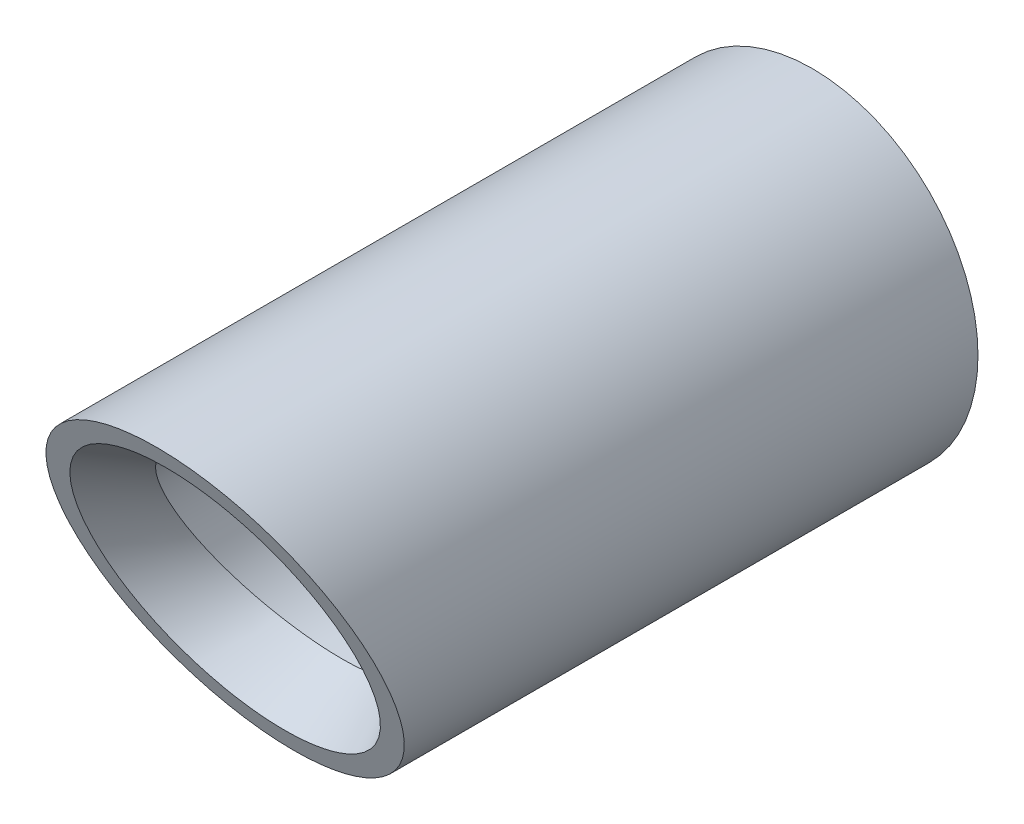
ISO-10303-21;
HEADER;
FILE_DESCRIPTION(('STEP AP214'),'2;1');
FILE_NAME('part.step','',(''),(''),'','','');
FILE_SCHEMA(('AUTOMOTIVE_DESIGN { 1 0 10303 214 1 1 1 1 }'));
ENDSEC;
DATA;
#1=APPLICATION_CONTEXT('core data for automotive mechanical design processes');
#2=APPLICATION_PROTOCOL_DEFINITION('international standard','automotive_design',2000,#1);
#3=PRODUCT_CONTEXT('',#1,'mechanical');
#4=PRODUCT('Part','Part','',(#3));
#5=PRODUCT_RELATED_PRODUCT_CATEGORY('part','',(#4));
#6=PRODUCT_DEFINITION_FORMATION('','',#4);
#7=PRODUCT_DEFINITION_CONTEXT('part definition',#1,'design');
#8=PRODUCT_DEFINITION('design','',#6,#7);
#9=PRODUCT_DEFINITION_SHAPE('','',#8);
#10=(LENGTH_UNIT() NAMED_UNIT(*) SI_UNIT(.MILLI.,.METRE.));
#11=(NAMED_UNIT(*) PLANE_ANGLE_UNIT() SI_UNIT($,.RADIAN.));
#12=(NAMED_UNIT(*) SI_UNIT($,.STERADIAN.) SOLID_ANGLE_UNIT());
#13=UNCERTAINTY_MEASURE_WITH_UNIT(LENGTH_MEASURE(1.E-05),#10,'distance_accuracy_value','');
#14=(GEOMETRIC_REPRESENTATION_CONTEXT(3) GLOBAL_UNCERTAINTY_ASSIGNED_CONTEXT((#13)) GLOBAL_UNIT_ASSIGNED_CONTEXT((#10,
#11,#12)) REPRESENTATION_CONTEXT('',''));
#15=CARTESIAN_POINT('',(0.,0.,0.));
#16=DIRECTION('',(0.,0.,1.));
#17=DIRECTION('',(1.,0.,0.));
#18=AXIS2_PLACEMENT_3D('',#15,#16,#17);
#19=CARTESIAN_POINT('',(0.,0.,30.));
#20=DIRECTION('',(0.,0.,-1.));
#21=DIRECTION('',(-1.,0.,0.));
#22=AXIS2_PLACEMENT_3D('',#19,#20,#21);
#23=CYLINDRICAL_SURFACE('',#22,5.);
#24=CARTESIAN_POINT('',(0.,0.,1.73205080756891));
#25=DIRECTION('',(0.,0.,1.));
#26=DIRECTION('',(1.,0.,0.));
#27=AXIS2_PLACEMENT_3D('',#24,#25,#26);
#28=CIRCLE('',#27,5.);
#29=CARTESIAN_POINT('',(5.,0.,1.73205080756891));
#30=VERTEX_POINT('',#29);
#31=EDGE_CURVE('E40',#30,#30,#28,.F.);
#32=ORIENTED_EDGE('',*,*,#31,.T.);
#33=EDGE_LOOP('',(#32));
#34=FACE_BOUND('',#33,.T.);
#35=CARTESIAN_POINT('',(-5.,0.,24.3936605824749));
#36=CARTESIAN_POINT('',(-5.0000003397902,-0.159161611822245,24.3081910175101));
#37=CARTESIAN_POINT('',(-4.99240063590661,-0.318190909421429,24.2224657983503));
#38=CARTESIAN_POINT('',(-4.96207160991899,-0.634952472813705,24.0511545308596));
#39=CARTESIAN_POINT('',(-4.93933648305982,-0.792684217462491,23.9655685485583));
#40=CARTESIAN_POINT('',(-4.87877492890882,-1.10591748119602,23.7949477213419));
#41=CARTESIAN_POINT('',(-4.84092095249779,-1.26141438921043,23.7099141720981));
#42=CARTESIAN_POINT('',(-4.75022491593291,-1.56876598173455,23.5412968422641));
#43=CARTESIAN_POINT('',(-4.69738436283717,-1.72062103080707,23.4577129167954));
#44=CARTESIAN_POINT('',(-4.57671977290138,-2.01983250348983,23.2924054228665));
#45=CARTESIAN_POINT('',(-4.50886158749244,-2.16717778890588,23.2106865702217));
#46=CARTESIAN_POINT('',(-4.35839340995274,-2.45578541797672,23.0501338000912));
#47=CARTESIAN_POINT('',(-4.27578428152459,-2.59704811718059,22.971299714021));
#48=CARTESIAN_POINT('',(-4.09610883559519,-2.87208395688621,22.8172871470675));
#49=CARTESIAN_POINT('',(-3.99904929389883,-3.0058605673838,22.7421069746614));
#50=CARTESIAN_POINT('',(-3.79077612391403,-3.2645955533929,22.5963034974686));
#51=CARTESIAN_POINT('',(-3.67956416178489,-3.38955496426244,22.5256796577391));
#52=CARTESIAN_POINT('',(-3.45291396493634,-3.61957727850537,22.395299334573));
#53=CARTESIAN_POINT('',(-3.33851990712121,-3.72543217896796,22.335125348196));
#54=CARTESIAN_POINT('',(-3.09872175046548,-3.92714384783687,22.2202202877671));
#55=CARTESIAN_POINT('',(-2.97331969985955,-4.02300246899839,22.1654882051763));
#56=CARTESIAN_POINT('',(-2.71235347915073,-4.20336492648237,22.0622872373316));
#57=CARTESIAN_POINT('',(-2.5767982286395,-4.28787855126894,22.0138129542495));
#58=CARTESIAN_POINT('',(-2.296414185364,-4.44434915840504,21.9239263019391));
#59=CARTESIAN_POINT('',(-2.151587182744,-4.51630855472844,21.8825125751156));
#60=CARTESIAN_POINT('',(-1.87465804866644,-4.63737144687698,21.8127340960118));
#61=CARTESIAN_POINT('',(-1.74358999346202,-4.68826206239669,21.7833554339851));
#62=CARTESIAN_POINT('',(-1.47650848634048,-4.7791011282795,21.7308781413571));
#63=CARTESIAN_POINT('',(-1.34049599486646,-4.81905169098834,21.7077782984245));
#64=CARTESIAN_POINT('',(-1.06475394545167,-4.88737776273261,21.6682284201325));
#65=CARTESIAN_POINT('',(-0.925027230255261,-4.91576186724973,21.6517734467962));
#66=CARTESIAN_POINT('',(-0.643029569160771,-4.96053287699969,21.6258296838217));
#67=CARTESIAN_POINT('',(-0.500758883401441,-4.9769210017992,21.6163401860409));
#68=CARTESIAN_POINT('',(-0.232272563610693,-4.99619087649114,21.6051590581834));
#69=CARTESIAN_POINT('',(-0.106187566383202,-5.00046190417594,21.6026657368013));
#70=CARTESIAN_POINT('',(0.145923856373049,-4.99945914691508,21.60324817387));
#71=CARTESIAN_POINT('',(0.271950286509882,-4.99418631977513,21.606323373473));
#72=CARTESIAN_POINT('',(0.522966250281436,-4.97416899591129,21.6179363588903));
#73=CARTESIAN_POINT('',(0.647955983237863,-4.95942636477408,21.6264730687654));
#74=CARTESIAN_POINT('',(0.895997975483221,-4.92066504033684,21.6489311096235));
#75=CARTESIAN_POINT('',(1.01905021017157,-4.89664622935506,21.662852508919));
#76=CARTESIAN_POINT('',(1.25862810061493,-4.84050920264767,21.6953606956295));
#77=CARTESIAN_POINT('',(1.37523832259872,-4.80866060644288,21.7137920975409));
#78=CARTESIAN_POINT('',(1.60514859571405,-4.7368772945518,21.7552795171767));
#79=CARTESIAN_POINT('',(1.71844726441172,-4.69693925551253,21.7783374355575));
#80=CARTESIAN_POINT('',(1.94101795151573,-4.60941955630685,21.8288406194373));
#81=CARTESIAN_POINT('',(2.05029052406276,-4.56183895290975,21.8562852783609));
#82=CARTESIAN_POINT('',(2.26428907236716,-4.45949148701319,21.9152146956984));
#83=CARTESIAN_POINT('',(2.36901464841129,-4.40472399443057,21.9466998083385));
#84=CARTESIAN_POINT('',(2.57994893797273,-4.28479932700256,22.0155614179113));
#85=CARTESIAN_POINT('',(2.68582681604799,-4.21920245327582,22.0531854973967));
#86=CARTESIAN_POINT('',(2.89140624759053,-4.08106690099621,22.1322822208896));
#87=CARTESIAN_POINT('',(2.99110844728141,-4.00852895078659,22.1737544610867));
#88=CARTESIAN_POINT('',(3.18399033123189,-3.8571023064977,22.2601475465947));
#89=CARTESIAN_POINT('',(3.27716944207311,-3.7782130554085,22.3050686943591));
#90=CARTESIAN_POINT('',(3.45673511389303,-3.61465712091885,22.3980510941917));
#91=CARTESIAN_POINT('',(3.54311755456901,-3.52998699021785,22.4461142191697));
#92=CARTESIAN_POINT('',(3.7186440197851,-3.34511444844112,22.5508002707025));
#93=CARTESIAN_POINT('',(3.80690182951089,-3.24426053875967,22.6077625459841));
#94=CARTESIAN_POINT('',(3.97432818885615,-3.03685874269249,22.7246398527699));
#95=CARTESIAN_POINT('',(4.05349275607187,-2.93030839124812,22.7845561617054));
#96=CARTESIAN_POINT('',(4.27711220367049,-2.60307767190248,22.9680545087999));
#97=CARTESIAN_POINT('',(4.40772229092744,-2.37478630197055,23.0954037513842));
#98=CARTESIAN_POINT('',(4.58198138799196,-2.00676308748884,23.2996048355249));
#99=CARTESIAN_POINT('',(4.63872770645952,-1.87177247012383,23.3742891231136));
#100=CARTESIAN_POINT('',(4.73993811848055,-1.59818825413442,23.5251163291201));
#101=CARTESIAN_POINT('',(4.78441391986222,-1.45959822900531,23.6012577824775));
#102=CARTESIAN_POINT('',(4.86104850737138,-1.1795407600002,23.754677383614));
#103=CARTESIAN_POINT('',(4.89319778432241,-1.03807118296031,23.831956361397));
#104=CARTESIAN_POINT('',(4.94507786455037,-0.753110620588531,23.9870519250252));
#105=CARTESIAN_POINT('',(4.96480504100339,-0.609619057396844,24.0648686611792));
#106=CARTESIAN_POINT('',(4.9928941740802,-0.309281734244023,24.2272669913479));
#107=CARTESIAN_POINT('',(5.00014706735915,-0.15233796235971,24.3118611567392));
#108=CARTESIAN_POINT('',(4.99984845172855,0.16180465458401,24.4805438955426));
#109=CARTESIAN_POINT('',(4.99229698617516,0.319003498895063,24.5646324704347));
#110=CARTESIAN_POINT('',(4.96232896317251,0.632533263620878,24.7318170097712));
#111=CARTESIAN_POINT('',(4.93991108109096,0.788864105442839,24.8149128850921));
#112=CARTESIAN_POINT('',(4.88015641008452,1.09959411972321,24.9794957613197));
#113=CARTESIAN_POINT('',(4.84281409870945,1.25399255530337,25.060982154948));
#114=CARTESIAN_POINT('',(4.75293216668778,1.56055087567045,25.2222821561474));
#115=CARTESIAN_POINT('',(4.70029673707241,1.71269008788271,25.3020817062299));
#116=CARTESIAN_POINT('',(4.57996974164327,2.01244804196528,25.4588257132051));
#117=CARTESIAN_POINT('',(4.51227941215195,2.16006715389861,25.5357704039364));
#118=CARTESIAN_POINT('',(4.39957508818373,2.3770548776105,25.6485218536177));
#119=CARTESIAN_POINT('',(4.36013336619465,2.44866267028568,25.6856710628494));
#120=CARTESIAN_POINT('',(4.27757017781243,2.59019409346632,25.7590176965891));
#121=CARTESIAN_POINT('',(4.23444966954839,2.66011815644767,25.7952153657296));
#122=CARTESIAN_POINT('',(4.09964078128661,2.86705867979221,25.90218353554));
#123=CARTESIAN_POINT('',(4.0024449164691,3.00135961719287,25.9713895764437));
#124=CARTESIAN_POINT('',(3.80151376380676,3.25150986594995,26.0999745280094));
#125=CARTESIAN_POINT('',(3.69878296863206,3.36798992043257,26.159701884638));
#126=CARTESIAN_POINT('',(3.48165257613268,3.59199178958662,26.2743555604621));
#127=CARTESIAN_POINT('',(3.36725988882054,3.69951884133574,26.3292846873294));
#128=CARTESIAN_POINT('',(3.12744698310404,3.90434745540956,26.433683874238));
#129=CARTESIAN_POINT('',(3.00203149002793,4.00165336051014,26.4831562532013));
#130=CARTESIAN_POINT('',(2.74101317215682,4.18476453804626,26.5761641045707));
#131=CARTESIAN_POINT('',(2.60541179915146,4.27057144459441,26.619700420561));
#132=CARTESIAN_POINT('',(2.34156135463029,4.42010253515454,26.695404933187));
#133=CARTESIAN_POINT('',(2.21432027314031,4.48523674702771,26.7283077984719));
#134=CARTESIAN_POINT('',(1.95364805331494,4.60475995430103,26.7886784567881));
#135=CARTESIAN_POINT('',(1.82021740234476,4.6591497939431,26.8161466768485));
#136=CARTESIAN_POINT('',(1.54827627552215,4.75643570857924,26.8652071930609));
#137=CARTESIAN_POINT('',(1.40976903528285,4.79933896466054,26.8868031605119));
#138=CARTESIAN_POINT('',(1.1287857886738,4.8730826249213,26.9239089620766));
#139=CARTESIAN_POINT('',(0.986310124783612,4.90392406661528,26.9394193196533));
#140=CARTESIAN_POINT('',(0.713388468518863,4.95057975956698,26.9628964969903));
#141=CARTESIAN_POINT('',(0.583200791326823,4.96760745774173,26.9714721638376));
#142=CARTESIAN_POINT('',(0.321657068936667,4.99137001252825,26.9834053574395));
#143=CARTESIAN_POINT('',(0.190301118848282,4.99810569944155,26.9867633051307));
#144=CARTESIAN_POINT('',(-0.0725264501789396,5.00120073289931,26.9883119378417));
#145=CARTESIAN_POINT('',(-0.203998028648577,4.99756286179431,26.9865040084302));
#146=CARTESIAN_POINT('',(-0.466072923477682,4.97996212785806,26.9776788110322));
#147=CARTESIAN_POINT('',(-0.596676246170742,4.96599934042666,26.9706615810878));
#148=CARTESIAN_POINT('',(-0.850526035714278,4.92872834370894,26.9519042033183));
#149=CARTESIAN_POINT('',(-0.973850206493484,4.90583986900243,26.9403761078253));
#150=CARTESIAN_POINT('',(-1.21794441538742,4.85100574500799,26.9127920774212));
#151=CARTESIAN_POINT('',(-1.33871457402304,4.81906052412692,26.8967363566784));
#152=CARTESIAN_POINT('',(-1.5769138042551,4.74645625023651,26.8601776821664));
#153=CARTESIAN_POINT('',(-1.69434283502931,4.70579709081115,26.8396746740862));
#154=CARTESIAN_POINT('',(-1.92515338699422,4.61617947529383,26.7944479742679));
#155=CARTESIAN_POINT('',(-2.03853464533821,4.56722048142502,26.7697240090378));
#156=CARTESIAN_POINT('',(-2.26376626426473,4.45997282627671,26.7155423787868));
#157=CARTESIAN_POINT('',(-2.3754816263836,4.40145863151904,26.6859701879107));
#158=CARTESIAN_POINT('',(-2.59331510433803,4.27673582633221,26.6228164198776));
#159=CARTESIAN_POINT('',(-2.69943397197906,4.21052825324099,26.5892353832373));
#160=CARTESIAN_POINT('',(-2.90557712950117,4.07100847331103,26.5183974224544));
#161=CARTESIAN_POINT('',(-3.0056019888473,3.99769693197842,26.4811408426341));
#162=CARTESIAN_POINT('',(-3.19919356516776,3.84452929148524,26.4032005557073));
#163=CARTESIAN_POINT('',(-3.29275614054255,3.76466906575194,26.3625146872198));
#164=CARTESIAN_POINT('',(-3.48021655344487,3.59243208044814,26.2745815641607));
#165=CARTESIAN_POINT('',(-3.57354010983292,3.49956514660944,26.2270697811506));
#166=CARTESIAN_POINT('',(-3.75184640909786,3.30768924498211,26.1287644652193));
#167=CARTESIAN_POINT('',(-3.83682552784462,3.20867763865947,26.077969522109));
#168=CARTESIAN_POINT('',(-3.99816325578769,3.00525435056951,25.9733791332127));
#169=CARTESIAN_POINT('',(-4.07451679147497,2.90083954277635,25.9195819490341));
#170=CARTESIAN_POINT('',(-4.21832325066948,2.68743425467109,25.8093712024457));
#171=CARTESIAN_POINT('',(-4.28577896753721,2.57844522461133,25.7529584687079));
#172=CARTESIAN_POINT('',(-4.41857948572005,2.34439311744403,25.6315864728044));
#173=CARTESIAN_POINT('',(-4.48288697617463,2.21887551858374,25.5663671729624));
#174=CARTESIAN_POINT('',(-4.60022929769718,1.96406588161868,25.4335570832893));
#175=CARTESIAN_POINT('',(-4.65327400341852,1.83477726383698,25.3659684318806));
#176=CARTESIAN_POINT('',(-4.74809043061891,1.57320553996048,25.2288916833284));
#177=CARTESIAN_POINT('',(-4.78986772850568,1.44092395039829,25.1594045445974));
#178=CARTESIAN_POINT('',(-4.86214696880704,1.17415009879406,25.0188511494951));
#179=CARTESIAN_POINT('',(-4.8926490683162,1.03965786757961,24.9477849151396));
#180=CARTESIAN_POINT('',(-4.94504029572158,0.754801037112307,24.7968127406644));
#181=CARTESIAN_POINT('',(-4.96566364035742,0.604273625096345,24.7167724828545));
#182=CARTESIAN_POINT('',(-4.99314343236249,0.302457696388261,24.5557852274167));
#183=CARTESIAN_POINT('',(-4.99999967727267,0.151169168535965,24.4748382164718));
#184=CARTESIAN_POINT('',(-5.,0.,24.3936605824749));
#185=B_SPLINE_CURVE_WITH_KNOTS('',3,(#35,#36,#37,#38,#39,#40,#41,#42,#43,#44,#45,#46,#47,#48,
#49,#50,#51,#52,#53,#54,#55,#56,#57,#58,#59,#60,#61,#62,#63,#64,#65,#66,#67,#68,#69,#70,#71,#72,
#73,#74,#75,#76,#77,#78,#79,#80,#81,#82,#83,#84,#85,#86,#87,#88,#89,#90,#91,#92,#93,#94,#95,#96,
#97,#98,#99,#100,#101,#102,#103,#104,#105,#106,#107,#108,#109,#110,#111,#112,#113,#114,#115,
#116,#117,#118,#119,#120,#121,#122,#123,#124,#125,#126,#127,#128,#129,#130,#131,#132,#133,#134,
#135,#136,#137,#138,#139,#140,#141,#142,#143,#144,#145,#146,#147,#148,#149,#150,#151,#152,#153,
#154,#155,#156,#157,#158,#159,#160,#161,#162,#163,#164,#165,#166,#167,#168,#169,#170,#171,#172,
#173,#174,#175,#176,#177,#178,#179,#180,#181,#182,#183,#184),.UNSPECIFIED.,.T.,.F.,(4,2,2,2,2,2,
2,2,2,2,2,2,2,2,2,2,2,2,2,2,2,2,2,2,2,2,2,2,2,2,2,2,2,2,2,2,2,2,2,2,2,2,2,2,2,2,2,2,2,2,2,2,2,2,
2,2,2,2,2,2,2,2,2,2,2,2,2,2,2,2,2,2,2,2,4),(0.,0.541824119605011,1.08385616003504,
1.62688041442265,2.16985008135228,2.71406732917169,3.25825272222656,3.80218374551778,
4.34605079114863,4.84654898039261,5.34695423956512,5.84692493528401,6.34679938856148,
6.77710730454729,7.20733207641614,7.63723654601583,8.06709730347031,8.44517246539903,
8.82320968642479,9.20117245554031,9.57914001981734,9.94556992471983,10.312150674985,
10.6786807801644,11.0452430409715,11.4351666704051,11.8250494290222,12.2149664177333,
12.6051179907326,13.0415126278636,13.4780976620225,14.3511294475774,14.8438680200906,
15.3361348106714,15.828780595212,16.3215701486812,16.8562632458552,17.3909547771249,
17.9256939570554,18.4606311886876,18.998994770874,19.5373141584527,19.8066191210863,
20.075854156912,20.6138937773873,21.1124193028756,21.610651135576,22.1086704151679,
22.6066188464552,23.0460636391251,23.4854738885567,23.9246087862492,24.3637059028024,
24.7579372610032,25.1521368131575,25.5462306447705,25.9403215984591,26.31776348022,
26.6951875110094,27.0726161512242,27.4500692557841,27.8382454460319,28.2263693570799,
28.6144569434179,29.0027909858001,29.4222527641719,29.8418959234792,30.2617846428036,
30.6815412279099,31.1471953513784,31.6124395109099,32.077452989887,32.542459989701,
33.0570683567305,33.5716842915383),.UNSPECIFIED.);
#186=CARTESIAN_POINT('',(-5.,0.,24.3936605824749));
#187=VERTEX_POINT('',#186);
#188=EDGE_CURVE('E144',#187,#187,#185,.T.);
#189=ORIENTED_EDGE('',*,*,#188,.T.);
#190=EDGE_LOOP('',(#189));
#191=FACE_BOUND('',#190,.T.);
#192=ADVANCED_FACE('F117',(#34,#191),#23,.F.);
#193=CARTESIAN_POINT('',(0.,0.,30.));
#194=DIRECTION('',(0.,0.,-1.));
#195=DIRECTION('',(-1.,0.,0.));
#196=AXIS2_PLACEMENT_3D('',#193,#194,#195);
#197=CYLINDRICAL_SURFACE('',#196,7.5);
#198=CARTESIAN_POINT('',(0.,0.,0.288675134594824));
#199=DIRECTION('',(0.,0.,-1.));
#200=DIRECTION('',(-1.,0.,0.));
#201=AXIS2_PLACEMENT_3D('',#198,#199,#200);
#202=CIRCLE('',#201,7.5);
#203=CARTESIAN_POINT('',(-7.5,0.,0.288675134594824));
#204=VERTEX_POINT('',#203);
#205=EDGE_CURVE('E127',#204,#204,#202,.F.);
#206=ORIENTED_EDGE('',*,*,#205,.T.);
#207=EDGE_LOOP('',(#206));
#208=FACE_BOUND('',#207,.T.);
#209=CARTESIAN_POINT('',(0.,0.,26.8933982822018));
#210=DIRECTION('',(0.,0.38268343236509,-0.923879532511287));
#211=DIRECTION('',(0.,-0.923879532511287,-0.38268343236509));
#212=AXIS2_PLACEMENT_3D('',#209,#210,#211);
#213=ELLIPSE('',#212,8.11794150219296,7.5);
#214=CARTESIAN_POINT('',(0.,-7.5,23.7867965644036));
#215=VERTEX_POINT('',#214);
#216=EDGE_CURVE('E132',#215,#215,#213,.T.);
#217=ORIENTED_EDGE('',*,*,#216,.T.);
#218=EDGE_LOOP('',(#217));
#219=FACE_BOUND('',#218,.T.);
#220=ADVANCED_FACE('F174',(#208,#219),#197,.T.);
#221=CARTESIAN_POINT('',(55.3029326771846,7.5,30.));
#222=DIRECTION('',(0.,0.38268343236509,-0.923879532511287));
#223=DIRECTION('',(0.,0.923879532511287,0.38268343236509));
#224=AXIS2_PLACEMENT_3D('',#221,#222,#223);
#225=PLANE('',#224);
#226=CARTESIAN_POINT('',(0.,6.5,29.5857864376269));
#227=CARTESIAN_POINT('',(-0.42542400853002,6.49999999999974,29.5857864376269));
#228=CARTESIAN_POINT('',(-0.850837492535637,6.45810042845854,29.5684310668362));
#229=CARTESIAN_POINT('',(-1.68533669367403,6.29210821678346,29.4996748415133));
#230=CARTESIAN_POINT('',(-2.09440178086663,6.16801967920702,29.4482756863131));
#231=CARTESIAN_POINT('',(-2.88048283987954,5.84241424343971,29.3134054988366));
#232=CARTESIAN_POINT('',(-3.25747938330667,5.64090539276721,29.2299377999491));
#233=CARTESIAN_POINT('',(-3.96493364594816,5.16819956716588,29.034136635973));
#234=CARTESIAN_POINT('',(-4.29537387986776,4.89701427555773,28.9218080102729));
#235=CARTESIAN_POINT('',(-4.89701427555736,4.2953738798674,28.6726003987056));
#236=CARTESIAN_POINT('',(-5.16819956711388,3.96493364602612,28.5357275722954));
#237=CARTESIAN_POINT('',(-5.64090539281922,3.25747938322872,28.2426904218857));
#238=CARTESIAN_POINT('',(-5.8424142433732,2.88048284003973,28.0865333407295));
#239=CARTESIAN_POINT('',(-6.16801967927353,2.09440178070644,27.7609279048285));
#240=CARTESIAN_POINT('',(-6.29210821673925,1.68533669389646,27.5914875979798));
#241=CARTESIAN_POINT('',(-6.45810042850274,0.850837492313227,27.2458267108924));
#242=CARTESIAN_POINT('',(-6.49999999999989,0.425424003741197,27.0696146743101));
#243=CARTESIAN_POINT('',(-6.50000000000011,-0.425424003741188,26.7171818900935));
#244=CARTESIAN_POINT('',(-6.45810042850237,-0.850837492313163,26.5409698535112));
#245=CARTESIAN_POINT('',(-6.29210821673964,-1.68533669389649,26.1953089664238));
#246=CARTESIAN_POINT('',(-6.1680196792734,-2.09440178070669,26.0258686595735));
#247=CARTESIAN_POINT('',(-5.84241424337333,-2.88048284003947,25.7002632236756));
#248=CARTESIAN_POINT('',(-5.64090539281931,-3.25747938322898,25.5441061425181));
#249=CARTESIAN_POINT('',(-5.16819956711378,-3.96493364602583,25.251068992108));
#250=CARTESIAN_POINT('',(-4.89701427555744,-4.29537387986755,25.1141961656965));
#251=CARTESIAN_POINT('',(-4.29537387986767,-4.89701427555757,24.8649885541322));
#252=CARTESIAN_POINT('',(-3.96493364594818,-5.16819956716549,24.7526599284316));
#253=CARTESIAN_POINT('',(-3.25747938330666,-5.64090539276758,24.5568587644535));
#254=CARTESIAN_POINT('',(-2.88048283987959,-5.84241424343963,24.4733910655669));
#255=CARTESIAN_POINT('',(-2.0944017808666,-6.16801967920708,24.3385208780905));
#256=CARTESIAN_POINT('',(-1.68533669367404,-6.29210821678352,24.2871217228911));
#257=CARTESIAN_POINT('',(-0.850837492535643,-6.45810042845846,24.2183654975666));
#258=CARTESIAN_POINT('',(-0.425424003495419,-6.5,24.2010101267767));
#259=CARTESIAN_POINT('',(0.425424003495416,-6.5,24.2010101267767));
#260=CARTESIAN_POINT('',(0.850837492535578,-6.45810042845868,24.2183654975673));
#261=CARTESIAN_POINT('',(1.68533669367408,-6.29210821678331,24.2871217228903));
#262=CARTESIAN_POINT('',(2.09440178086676,-6.16801967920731,24.33852087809));
#263=CARTESIAN_POINT('',(2.88048283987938,-5.84241424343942,24.4733910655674));
#264=CARTESIAN_POINT('',(3.25747938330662,-5.64090539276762,24.5568587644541));
#265=CARTESIAN_POINT('',(3.9649336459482,-5.16819956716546,24.7526599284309));
#266=CARTESIAN_POINT('',(4.29537387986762,-4.89701427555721,24.8649885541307));
#267=CARTESIAN_POINT('',(4.8970142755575,-4.2953738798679,25.114196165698));
#268=CARTESIAN_POINT('',(5.16819956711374,-3.96493364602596,25.2510689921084));
#269=CARTESIAN_POINT('',(5.64090539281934,-3.25747938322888,25.5441061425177));
#270=CARTESIAN_POINT('',(5.84241424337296,-2.8804828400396,25.7002632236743));
#271=CARTESIAN_POINT('',(6.16801967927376,-2.09440178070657,26.0258686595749));
#272=CARTESIAN_POINT('',(6.29210821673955,-1.68533669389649,26.1953089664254));
#273=CARTESIAN_POINT('',(6.45810042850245,-0.850837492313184,26.5409698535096));
#274=CARTESIAN_POINT('',(6.49999999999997,-0.42542400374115,26.7171818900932));
#275=CARTESIAN_POINT('',(6.50000000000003,0.425424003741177,27.0696146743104));
#276=CARTESIAN_POINT('',(6.458100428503,0.850837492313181,27.2458267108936));
#277=CARTESIAN_POINT('',(6.292108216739,1.68533669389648,27.5914875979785));
#278=CARTESIAN_POINT('',(6.16801967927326,2.09440178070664,27.7609279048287));
#279=CARTESIAN_POINT('',(5.84241424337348,2.88048284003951,28.0865333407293));
#280=CARTESIAN_POINT('',(5.64090539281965,3.25747938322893,28.2426904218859));
#281=CARTESIAN_POINT('',(5.16819956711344,3.9649336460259,28.5357275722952));
#282=CARTESIAN_POINT('',(4.89701427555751,4.29537387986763,28.6726003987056));
#283=CARTESIAN_POINT('',(4.29537387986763,4.89701427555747,28.9218080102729));
#284=CARTESIAN_POINT('',(3.96493364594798,5.16819956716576,29.0341366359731));
#285=CARTESIAN_POINT('',(3.25747938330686,5.64090539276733,29.229937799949));
#286=CARTESIAN_POINT('',(2.88048283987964,5.84241424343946,29.3134054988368));
#287=CARTESIAN_POINT('',(2.09440178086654,6.16801967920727,29.4482756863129));
#288=CARTESIAN_POINT('',(1.68533669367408,6.29210821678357,29.4996748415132));
#289=CARTESIAN_POINT('',(0.850837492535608,6.45810042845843,29.5684310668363));
#290=CARTESIAN_POINT('',(0.425424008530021,6.50000000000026,29.5857864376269));
#291=CARTESIAN_POINT('',(0.,6.5,29.5857864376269));
#292=B_SPLINE_CURVE_WITH_KNOTS('',3,(#226,#227,#228,#229,#230,#231,#232,#233,#234,#235,#236,
#237,#238,#239,#240,#241,#242,#243,#244,#245,#246,#247,#248,#249,#250,#251,#252,#253,#254,#255,
#256,#257,#258,#259,#260,#261,#262,#263,#264,#265,#266,#267,#268,#269,#270,#271,#272,#273,#274,
#275,#276,#277,#278,#279,#280,#281,#282,#283,#284,#285,#286,#287,#288,#289,#290,#291),
.UNSPECIFIED.,.T.,.F.,(4,2,2,2,2,2,2,2,2,2,2,2,2,2,2,2,2,2,2,2,2,2,2,2,2,2,2,2,2,2,2,2,4),(0.,
0.196349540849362,0.392699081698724,0.589048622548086,0.785398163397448,0.98174770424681,
1.17809724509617,1.37444678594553,1.5707963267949,1.76714586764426,1.96349540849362,
2.15984494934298,2.35619449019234,2.55254403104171,2.74889357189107,2.94524311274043,
3.14159265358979,3.33794219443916,3.53429173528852,3.73064127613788,3.92699081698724,
4.1233403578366,4.31968989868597,4.51603943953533,4.71238898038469,4.90873852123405,
5.10508806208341,5.30143760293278,5.49778714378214,5.6941366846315,5.89048622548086,
6.08683576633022,6.28318530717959),.UNSPECIFIED.);
#293=CARTESIAN_POINT('',(0.,6.5,29.5857864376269));
#294=VERTEX_POINT('',#293);
#295=EDGE_CURVE('E138',#294,#294,#292,.T.);
#296=ORIENTED_EDGE('',*,*,#295,.F.);
#297=EDGE_LOOP('',(#296));
#298=FACE_BOUND('',#297,.T.);
#299=ORIENTED_EDGE('',*,*,#216,.F.);
#300=EDGE_LOOP('',(#299));
#301=FACE_BOUND('',#300,.T.);
#302=ADVANCED_FACE('F139',(#298,#301),#225,.F.);
#303=CARTESIAN_POINT('',(0.,0.,0.));
#304=DIRECTION('',(0.,0.,-1.));
#305=DIRECTION('',(-1.,0.,0.));
#306=AXIS2_PLACEMENT_3D('',#303,#304,#305);
#307=CONICAL_SURFACE('',#306,8.00000000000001,1.04719755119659);
#308=ORIENTED_EDGE('',*,*,#31,.F.);
#309=EDGE_LOOP('',(#308));
#310=FACE_BOUND('',#309,.T.);
#311=ORIENTED_EDGE('',*,*,#205,.F.);
#312=EDGE_LOOP('',(#311));
#313=FACE_BOUND('',#312,.T.);
#314=ADVANCED_FACE('F119',(#310,#313),#307,.F.);
#315=CARTESIAN_POINT('',(0.,1.47037612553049,20.8742223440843));
#316=CARTESIAN_POINT('',(-0.174960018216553,1.47037612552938,20.8742223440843));
#317=CARTESIAN_POINT('',(-0.349900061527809,1.44714963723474,20.8568669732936));
#318=CARTESIAN_POINT('',(-0.68624700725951,1.35628144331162,20.7881107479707));
#319=CARTESIAN_POINT('',(-0.847614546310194,1.28864976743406,20.7367115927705));
#320=CARTESIAN_POINT('',(-1.1444364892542,1.1149548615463,20.601841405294));
#321=CARTESIAN_POINT('',(-1.27985368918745,1.00891244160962,20.5183737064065));
#322=CARTESIAN_POINT('',(-1.51474387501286,0.767866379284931,20.3225725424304));
#323=CARTESIAN_POINT('',(-1.61418462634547,0.632895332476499,20.2102439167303));
#324=CARTESIAN_POINT('',(-1.77049413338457,0.34615142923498,19.961036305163));
#325=CARTESIAN_POINT('',(-1.82734016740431,0.194423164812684,19.8241634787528));
#326=CARTESIAN_POINT('',(-1.89607976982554,-0.112145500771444,19.5311263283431));
#327=CARTESIAN_POINT('',(-1.90796615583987,-0.266931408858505,19.3749692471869));
#328=CARTESIAN_POINT('',(-1.88912637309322,-0.565893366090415,19.0493638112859));
#329=CARTESIAN_POINT('',(-1.85841460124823,-0.710010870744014,18.8799235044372));
#330=CARTESIAN_POINT('',(-1.76135280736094,-0.975604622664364,18.5342626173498));
#331=CARTESIAN_POINT('',(-1.69504211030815,-1.09702823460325,18.3580505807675));
#332=CARTESIAN_POINT('',(-1.53759386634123,-1.30860376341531,18.0056177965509));
#333=CARTESIAN_POINT('',(-1.44651826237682,-1.3987212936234,17.8294057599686));
#334=CARTESIAN_POINT('',(-1.25265363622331,-1.54380937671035,17.4837448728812));
#335=CARTESIAN_POINT('',(-1.1499397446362,-1.59877470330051,17.3143045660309));
#336=CARTESIAN_POINT('',(-0.946114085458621,-1.6750712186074,16.988699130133));
#337=CARTESIAN_POINT('',(-0.845075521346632,-1.69643146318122,16.8325420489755));
#338=CARTESIAN_POINT('',(-0.655830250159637,-1.7120737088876,16.5395048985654));
#339=CARTESIAN_POINT('',(-0.567678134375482,-1.70641567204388,16.4026320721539));
#340=CARTESIAN_POINT('',(-0.411368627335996,-1.67826308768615,16.1534244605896));
#341=CARTESIAN_POINT('',(-0.34323395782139,-1.65584783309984,16.0410958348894));
#342=CARTESIAN_POINT('',(-0.228849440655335,-1.60596747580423,15.8452946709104));
#343=CARTESIAN_POINT('',(-0.182584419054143,-1.5785842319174,15.7618269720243));
#344=CARTESIAN_POINT('',(-0.108427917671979,-1.52961369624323,15.6269567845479));
#345=CARTESIAN_POINT('',(-0.0804860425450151,-1.50809319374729,15.5755576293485));
#346=CARTESIAN_POINT('',(-0.035065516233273,-1.47845571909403,15.506801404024));
#347=CARTESIAN_POINT('',(-0.0175117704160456,-1.47037612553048,15.4894460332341));
#348=CARTESIAN_POINT('',(0.0175117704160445,-1.47037612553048,15.4894460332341));
#349=CARTESIAN_POINT('',(0.0350655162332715,-1.47845571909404,15.5068014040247));
#350=CARTESIAN_POINT('',(0.0804860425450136,-1.5080931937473,15.5755576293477));
#351=CARTESIAN_POINT('',(0.108427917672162,-1.52961369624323,15.6269567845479));
#352=CARTESIAN_POINT('',(0.182584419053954,-1.5785842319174,15.7618269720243));
#353=CARTESIAN_POINT('',(0.22884944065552,-1.60596747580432,15.8452946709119));
#354=CARTESIAN_POINT('',(0.343233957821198,-1.65584783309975,16.0410958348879));
#355=CARTESIAN_POINT('',(0.41136862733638,-1.67826308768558,16.1534244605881));
#356=CARTESIAN_POINT('',(0.567678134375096,-1.70641567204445,16.4026320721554));
#357=CARTESIAN_POINT('',(0.655830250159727,-1.71207370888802,16.5395048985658));
#358=CARTESIAN_POINT('',(0.845075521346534,-1.69643146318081,16.8325420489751));
#359=CARTESIAN_POINT('',(0.946114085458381,-1.67507121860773,16.9886991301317));
#360=CARTESIAN_POINT('',(1.14993974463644,-1.59877470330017,17.3143045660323));
#361=CARTESIAN_POINT('',(1.25265363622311,-1.54380937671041,17.4837448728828));
#362=CARTESIAN_POINT('',(1.44651826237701,-1.39872129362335,17.829405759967));
#363=CARTESIAN_POINT('',(1.53759386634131,-1.30860376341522,18.0056177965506));
#364=CARTESIAN_POINT('',(1.69504211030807,-1.09702823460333,18.3580505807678));
#365=CARTESIAN_POINT('',(1.76135280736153,-0.975604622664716,18.5342626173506));
#366=CARTESIAN_POINT('',(1.85841460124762,-0.710010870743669,18.8799235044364));
#367=CARTESIAN_POINT('',(1.88912637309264,-0.565893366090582,19.0493638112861));
#368=CARTESIAN_POINT('',(1.90796615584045,-0.266931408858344,19.3749692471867));
#369=CARTESIAN_POINT('',(1.89607976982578,-0.11214550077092,19.5311263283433));
#370=CARTESIAN_POINT('',(1.82734016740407,0.194423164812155,19.8241634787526));
#371=CARTESIAN_POINT('',(1.77049413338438,0.34615142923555,19.961036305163));
#372=CARTESIAN_POINT('',(1.61418462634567,0.632895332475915,20.2102439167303));
#373=CARTESIAN_POINT('',(1.51474387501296,0.767866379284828,20.3225725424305));
#374=CARTESIAN_POINT('',(1.27985368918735,1.00891244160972,20.5183737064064));
#375=CARTESIAN_POINT('',(1.14443648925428,1.11495486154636,20.6018414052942));
#376=CARTESIAN_POINT('',(0.847614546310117,1.28864976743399,20.7367115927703));
#377=CARTESIAN_POINT('',(0.686247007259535,1.35628144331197,20.7881107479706));
#378=CARTESIAN_POINT('',(0.34990006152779,1.44714963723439,20.8568669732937));
#379=CARTESIAN_POINT('',(0.174960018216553,1.4703761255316,20.8742223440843));
#380=CARTESIAN_POINT('',(0.,1.47037612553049,20.8742223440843));
#381=CARTESIAN_POINT('',(0.,10.2306824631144,36.0475180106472));
#382=CARTESIAN_POINT('',(-0.611203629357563,10.2306824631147,36.0475180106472));
#383=CARTESIAN_POINT('',(-1.22240374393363,10.1749322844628,36.0301626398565));
#384=CARTESIAN_POINT('',(-2.42640331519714,9.95321744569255,35.9614064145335));
#385=CARTESIAN_POINT('',(-3.01919603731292,9.78725249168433,35.9100072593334));
#386=CARTESIAN_POINT('',(-4.16818105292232,9.34896866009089,35.7751370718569));
#387=CARTESIAN_POINT('',(-4.72436710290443,9.0766483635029,35.6916693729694));
#388=CARTESIAN_POINT('',(-5.78234191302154,8.43211079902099,35.4958682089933));
#389=CARTESIAN_POINT('',(-6.2841241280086,8.05988970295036,35.3835395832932));
#390=CARTESIAN_POINT('',(-7.21608507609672,7.2246774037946,35.1343319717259));
#391=CARTESIAN_POINT('',(-7.64625476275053,6.7616790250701,34.9974591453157));
#392=CARTESIAN_POINT('',(-8.41859923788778,5.75687114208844,34.704421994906));
#393=CARTESIAN_POINT('',(-8.76075900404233,5.21505167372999,34.5482649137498));
#394=CARTESIAN_POINT('',(-9.34185386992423,4.06765399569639,34.2226594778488));
#395=CARTESIAN_POINT('',(-9.58076427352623,3.46206620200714,34.0532191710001));
#396=CARTESIAN_POINT('',(-9.94187464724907,2.20558602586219,33.7075582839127));
#397=CARTESIAN_POINT('',(-10.0640383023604,1.55469052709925,33.5313462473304));
#398=CARTESIAN_POINT('',(-10.180824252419,0.229667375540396,33.1789134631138));
#399=CARTESIAN_POINT('',(-10.1754006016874,-0.444449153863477,33.0027014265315));
#400=CARTESIAN_POINT('',(-10.0300825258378,-1.79031342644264,32.6570405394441));
#401=CARTESIAN_POINT('',(-9.89013951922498,-2.46202912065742,32.4876002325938));
#402=CARTESIAN_POINT('',(-9.47420492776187,-3.77458707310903,32.1619947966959));
#403=CARTESIAN_POINT('',(-9.19817306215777,-4.41537393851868,32.0058377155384));
#404=CARTESIAN_POINT('',(-8.51521268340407,-5.63597411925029,31.7128005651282));
#405=CARTESIAN_POINT('',(-8.10826402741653,-6.2157125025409,31.5759277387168));
#406=CARTESIAN_POINT('',(-7.17630307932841,-7.28449670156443,31.3267201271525));
#407=CARTESIAN_POINT('',(-6.65129983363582,-7.77345780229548,31.2143915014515));
#408=CARTESIAN_POINT('',(-5.50394092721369,-8.63378766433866,31.0185903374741));
#409=CARTESIAN_POINT('',(-4.88162697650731,-9.00507535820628,30.9351226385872));
#410=CARTESIAN_POINT('',(-3.56748168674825,-9.60851946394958,30.8002524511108));
#411=CARTESIAN_POINT('',(-2.87572156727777,-9.8406123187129,30.7488532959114));
#412=CARTESIAN_POINT('',(-1.45592969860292,-10.1517112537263,30.6800970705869));
#413=CARTESIAN_POINT('',(-0.727989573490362,-10.2306824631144,30.662741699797));
#414=CARTESIAN_POINT('',(0.727989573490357,-10.2306824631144,30.662741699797));
#415=CARTESIAN_POINT('',(1.45592969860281,-10.1517112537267,30.6800970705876));
#416=CARTESIAN_POINT('',(2.87572156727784,-9.84061231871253,30.7488532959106));
#417=CARTESIAN_POINT('',(3.5674816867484,-9.60851946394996,30.80025245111));
#418=CARTESIAN_POINT('',(4.88162697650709,-9.00507535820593,30.935122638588));
#419=CARTESIAN_POINT('',(5.50394092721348,-8.63378766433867,31.0185903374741));
#420=CARTESIAN_POINT('',(6.651299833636,-7.77345780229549,31.2143915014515));
#421=CARTESIAN_POINT('',(7.17630307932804,-7.28449670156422,31.326720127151));
#422=CARTESIAN_POINT('',(8.10826402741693,-6.21571250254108,31.5759277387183));
#423=CARTESIAN_POINT('',(8.51521268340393,-5.6359741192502,31.7128005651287));
#424=CARTESIAN_POINT('',(9.19817306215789,-4.41537393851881,32.005837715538));
#425=CARTESIAN_POINT('',(9.4742049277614,-3.77458707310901,32.1619947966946));
#426=CARTESIAN_POINT('',(9.89013951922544,-2.46202912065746,32.4876002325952));
#427=CARTESIAN_POINT('',(10.0300825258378,-1.79031342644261,32.6570405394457));
#428=CARTESIAN_POINT('',(10.1754006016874,-0.444449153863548,33.0027014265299));
#429=CARTESIAN_POINT('',(10.1808242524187,0.229667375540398,33.1789134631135));
#430=CARTESIAN_POINT('',(10.0640383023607,1.55469052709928,33.5313462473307));
#431=CARTESIAN_POINT('',(9.94187464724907,2.20558602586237,33.7075582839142));
#432=CARTESIAN_POINT('',(9.58076427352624,3.46206620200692,34.0532191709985));
#433=CARTESIAN_POINT('',(9.34185386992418,4.06765399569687,34.222659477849));
#434=CARTESIAN_POINT('',(8.76075900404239,5.21505167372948,34.5482649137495));
#435=CARTESIAN_POINT('',(8.41859923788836,5.75687114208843,34.7044219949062));
#436=CARTESIAN_POINT('',(7.64625476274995,6.76167902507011,34.9974591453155));
#437=CARTESIAN_POINT('',(7.21608507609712,7.22467740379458,35.1343319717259));
#438=CARTESIAN_POINT('',(6.28412412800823,8.05988970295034,35.3835395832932));
#439=CARTESIAN_POINT('',(5.78234191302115,8.43211079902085,35.4958682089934));
#440=CARTESIAN_POINT('',(4.72436710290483,9.07664836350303,35.6916693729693));
#441=CARTESIAN_POINT('',(4.16818105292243,9.34896866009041,35.7751370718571));
#442=CARTESIAN_POINT('',(3.01919603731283,9.78725249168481,35.9100072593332));
#443=CARTESIAN_POINT('',(2.4264033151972,9.95321744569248,35.9614064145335));
#444=CARTESIAN_POINT('',(1.22240374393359,10.1749322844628,36.0301626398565));
#445=CARTESIAN_POINT('',(0.611203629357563,10.230682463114,36.0475180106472));
#446=CARTESIAN_POINT('',(0.,10.2306824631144,36.0475180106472));
#447=B_SPLINE_SURFACE_WITH_KNOTS('',1,3,((#315,#316,#317,#318,#319,#320,#321,#322,#323,#324,
#325,#326,#327,#328,#329,#330,#331,#332,#333,#334,#335,#336,#337,#338,#339,#340,#341,#342,#343,
#344,#345,#346,#347,#348,#349,#350,#351,#352,#353,#354,#355,#356,#357,#358,#359,#360,#361,#362,
#363,#364,#365,#366,#367,#368,#369,#370,#371,#372,#373,#374,#375,#376,#377,#378,#379,#380),
(#381,#382,#383,#384,#385,#386,#387,#388,#389,#390,#391,#392,#393,#394,#395,#396,#397,#398,#399,
#400,#401,#402,#403,#404,#405,#406,#407,#408,#409,#410,#411,#412,#413,#414,#415,#416,#417,#418,
#419,#420,#421,#422,#423,#424,#425,#426,#427,#428,#429,#430,#431,#432,#433,#434,#435,#436,#437,
#438,#439,#440,#441,#442,#443,#444,#445,#446)),.UNSPECIFIED.,.F.,.T.,.F.,(2,2),(4,2,2,2,2,2,2,2,
2,2,2,2,2,2,2,2,2,2,2,2,2,2,2,2,2,2,2,2,2,2,2,2,4),(0.,1.),(0.,0.196349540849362,
0.392699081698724,0.589048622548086,0.785398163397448,0.98174770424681,1.17809724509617,
1.37444678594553,1.5707963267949,1.76714586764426,1.96349540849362,2.15984494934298,
2.35619449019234,2.55254403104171,2.74889357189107,2.94524311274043,3.14159265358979,
3.33794219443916,3.53429173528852,3.73064127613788,3.92699081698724,4.1233403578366,
4.31968989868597,4.51603943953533,4.71238898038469,4.90873852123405,5.10508806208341,
5.30143760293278,5.49778714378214,5.6941366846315,5.89048622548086,6.08683576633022,
6.28318530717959),.UNSPECIFIED.);
#448=ORIENTED_EDGE('',*,*,#188,.F.);
#449=EDGE_LOOP('',(#448));
#450=FACE_BOUND('',#449,.T.);
#451=ORIENTED_EDGE('',*,*,#295,.T.);
#452=EDGE_LOOP('',(#451));
#453=FACE_BOUND('',#452,.T.);
#454=ADVANCED_FACE('F160',(#450,#453),#447,.T.);
#455=CLOSED_SHELL('',(#192,#220,#302,#314,#454));
#456=MANIFOLD_SOLID_BREP('B6',#455);
#457=ADVANCED_BREP_SHAPE_REPRESENTATION('',(#18,#456),#14);
#458=SHAPE_DEFINITION_REPRESENTATION(#9,#457);
ENDSEC;
END-ISO-10303-21;
